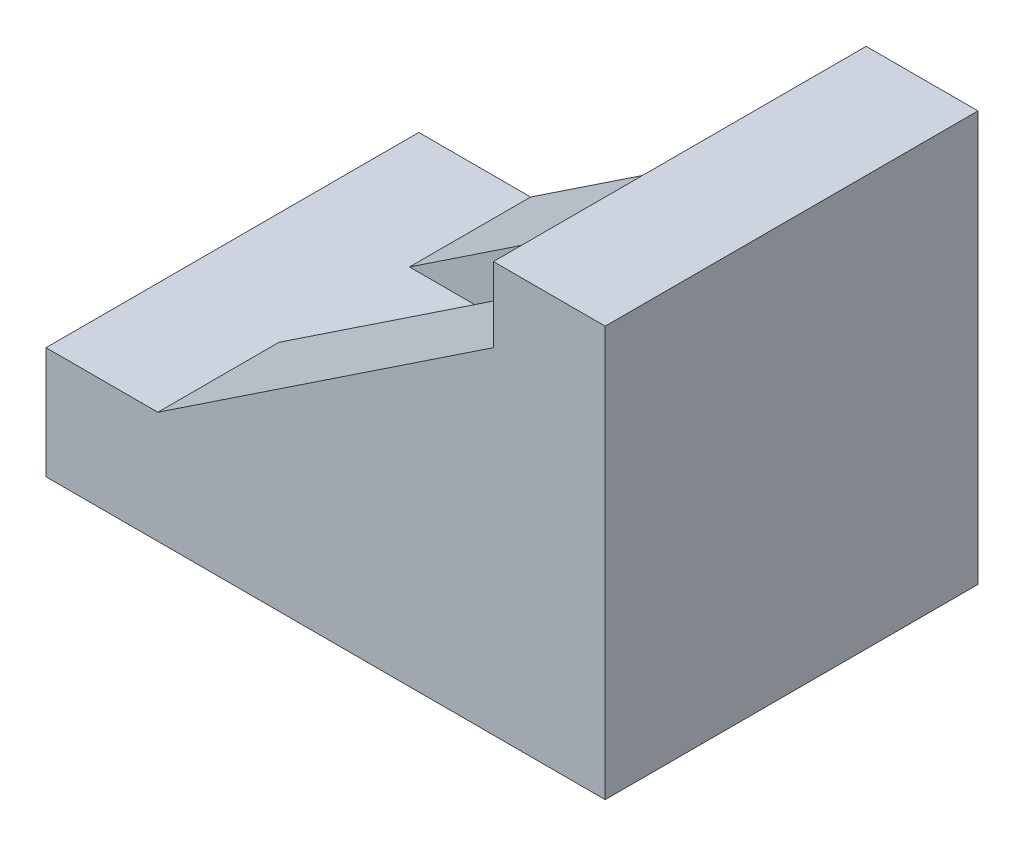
from build123d import *

# Parameters (mm, degrees)
EXTRUDE_1_DEPTH     = 10
CUT_EXTRUDE_1_DEPTH = 3.5


with BuildPart() as part:
    # Sketch 1 → Extrude 1 (new, symmetric)
    with BuildSketch(Plane.XY):
        Polygon((0, 0), (30, 0), (30, 22), (24, 22), (24, 18), (6, 6), (0, 6), align=None)
    extrude(amount=EXTRUDE_1_DEPTH, both=True)

    # Sketch 2 → Cut-Extrude 1 (cut, symmetric)
    with BuildSketch(Plane.XY):
        Polygon((24, 18), (24, 6), (6, 6), align=None)
    extrude(amount=CUT_EXTRUDE_1_DEPTH, both=True, mode=Mode.SUBTRACT)


solid = part.part
